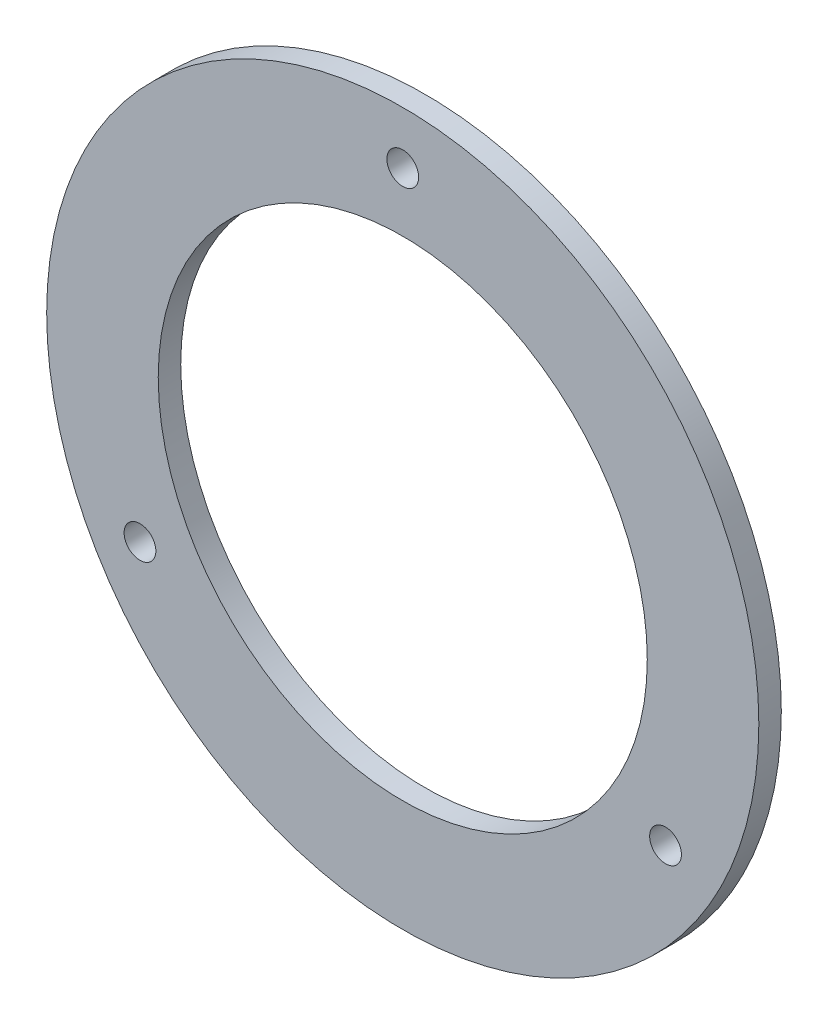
from build123d import *

# Parameters (mm, degrees)
SKETCH1_R             = 25.3365
SKETCH1_R_2           = 17.399
BOSS_EXTRUDE1_DEPTH   = 1.6002
F_2_CLEARANCE_HOLE1_D = 2.2606


with BuildPart() as part:
    # Sketch1 → Boss-Extrude1 (new body)
    with BuildSketch(Plane.XY):
        Circle(SKETCH1_R)
        Circle(SKETCH1_R_2, mode=Mode.SUBTRACT)
    extrude(amount=BOSS_EXTRUDE1_DEPTH)

    # 2 Clearance Hole1 (through all)
    with Locations(Plane.XY.offset(1.6002)):
        with Locations((0, 21.59), (18.697488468, -10.795), (-18.697488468, -10.795)):
            Hole(F_2_CLEARANCE_HOLE1_D / 2)


solid = part.part
